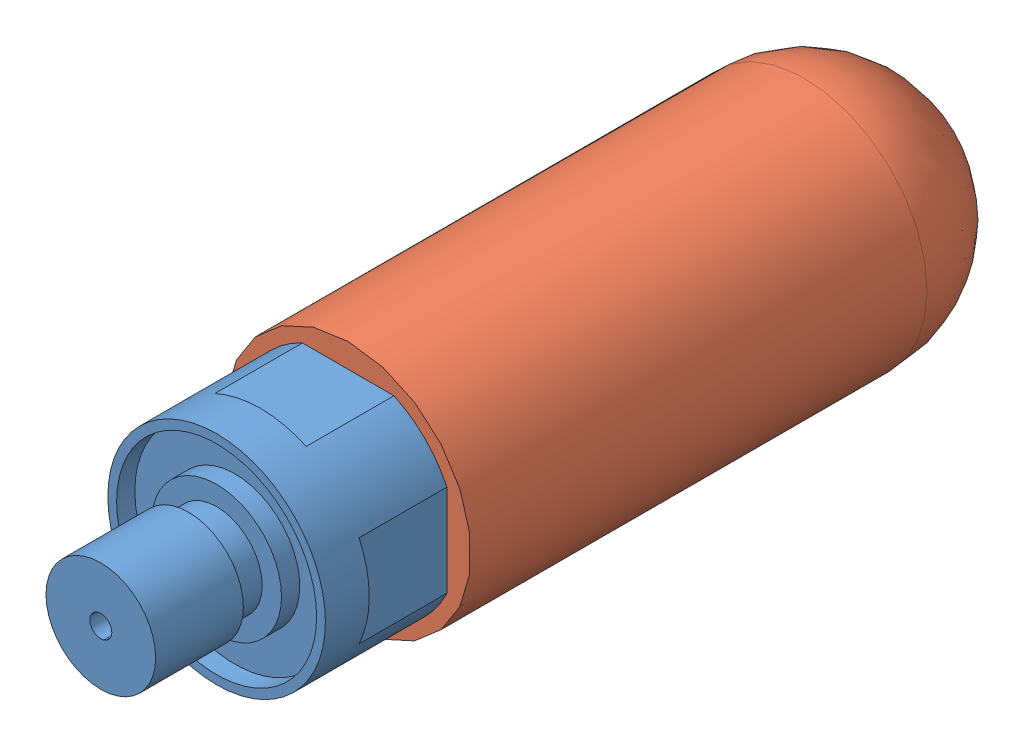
SolidWorks assembly Ext_Press.SLDASM, configuration Default (file format 3400). Lengths in mm.
Overall size (17.78 17.78 59.82).
2 component instances, 2 part files, 2 mates.
Components (placement in the parent):
- GSC_6390_press_ext_adapter-1: GSC_6390_press_ext_adapter.SLDPRT [Default] at (-33.9696 -40.0701 -51.2998) size (15.75 15.75 25.02)
- Daigger External Pressure Bulb-1: Daigger External Pressure Bulb.SLDPRT [Default] at (-33.9696 -40.0701 -60.8248) x (1 0 0) z (0 1 0) size (17.78 41.91 17.78)
Mates (geometry in assembly coordinates):
- Coincident1: coincident: plane of ?; plane of ?
- Concentric1: concentric aligned: cylinder of ?; cylinder of ?
